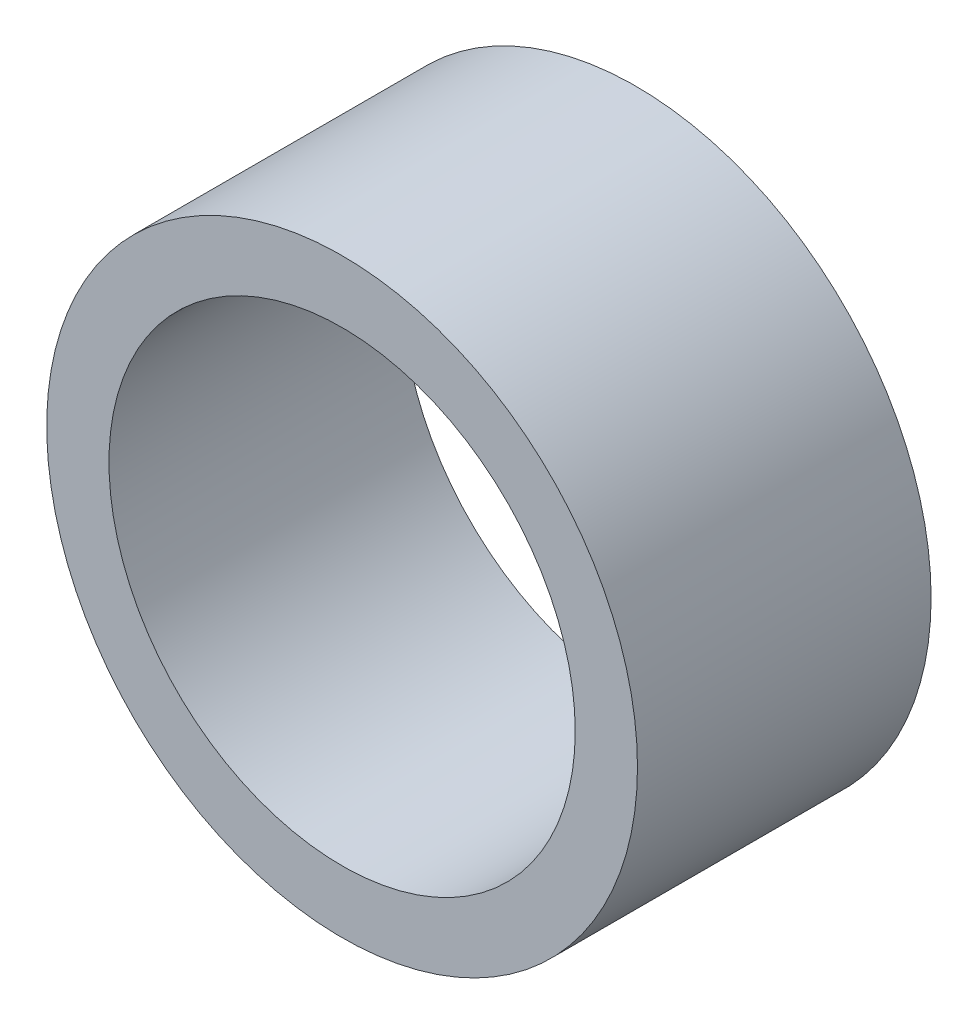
from build123d import *

# Parameters (mm, degrees)
SKETCH1_R      = 251.5
SKETCH1_R_2    = 198.5
EXTRUDE1_DEPTH = 250


with BuildPart() as part:
    # Sketch1 → Extrude1 (new body)
    with BuildSketch(Plane.XY):
        Circle(SKETCH1_R)
        Circle(SKETCH1_R_2, mode=Mode.SUBTRACT)
    extrude(amount=EXTRUDE1_DEPTH)


solid = part.part
